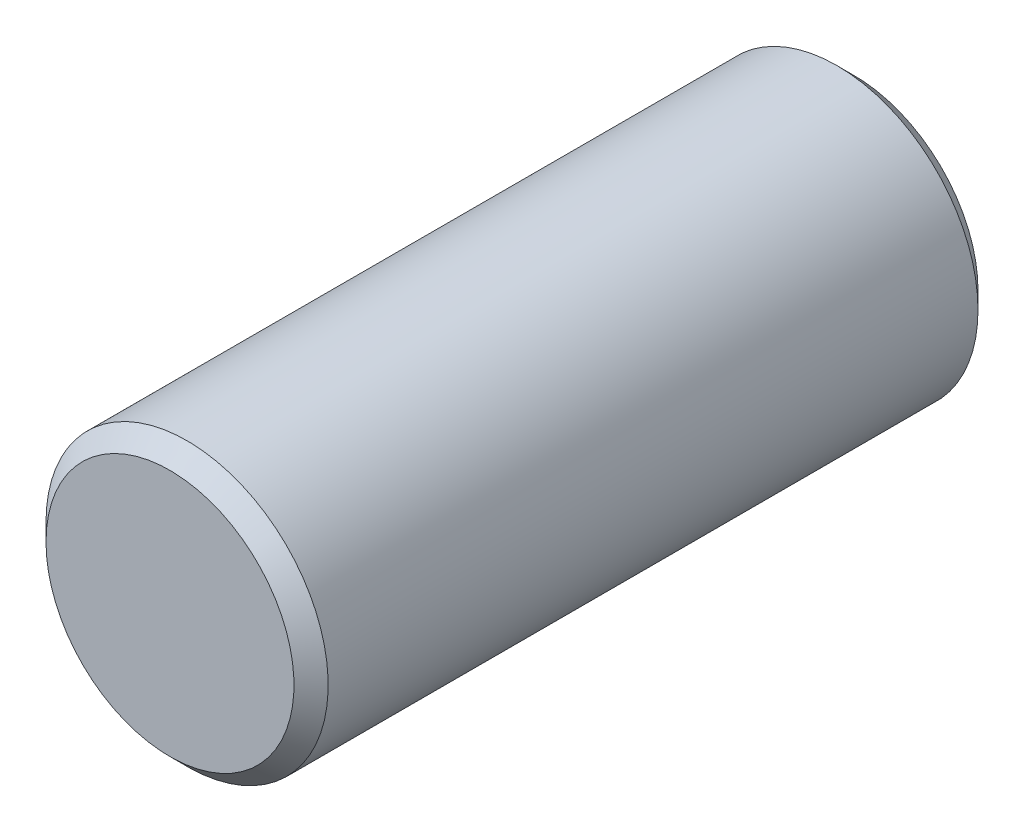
ISO-10303-21;
HEADER;
FILE_DESCRIPTION(('STEP AP214'),'2;1');
FILE_NAME('part.step','',(''),(''),'','','');
FILE_SCHEMA(('AUTOMOTIVE_DESIGN { 1 0 10303 214 1 1 1 1 }'));
ENDSEC;
DATA;
#1=APPLICATION_CONTEXT('core data for automotive mechanical design processes');
#2=APPLICATION_PROTOCOL_DEFINITION('international standard','automotive_design',2000,#1);
#3=PRODUCT_CONTEXT('',#1,'mechanical');
#4=PRODUCT('Part','Part','',(#3));
#5=PRODUCT_RELATED_PRODUCT_CATEGORY('part','',(#4));
#6=PRODUCT_DEFINITION_FORMATION('','',#4);
#7=PRODUCT_DEFINITION_CONTEXT('part definition',#1,'design');
#8=PRODUCT_DEFINITION('design','',#6,#7);
#9=PRODUCT_DEFINITION_SHAPE('','',#8);
#10=(LENGTH_UNIT() NAMED_UNIT(*) SI_UNIT(.MILLI.,.METRE.));
#11=(NAMED_UNIT(*) PLANE_ANGLE_UNIT() SI_UNIT($,.RADIAN.));
#12=(NAMED_UNIT(*) SI_UNIT($,.STERADIAN.) SOLID_ANGLE_UNIT());
#13=UNCERTAINTY_MEASURE_WITH_UNIT(LENGTH_MEASURE(1.E-05),#10,'distance_accuracy_value','');
#14=(GEOMETRIC_REPRESENTATION_CONTEXT(3) GLOBAL_UNCERTAINTY_ASSIGNED_CONTEXT((#13)) GLOBAL_UNIT_ASSIGNED_CONTEXT((#10,
#11,#12)) REPRESENTATION_CONTEXT('',''));
#15=CARTESIAN_POINT('',(0.,0.,0.));
#16=DIRECTION('',(0.,0.,1.));
#17=DIRECTION('',(1.,0.,0.));
#18=AXIS2_PLACEMENT_3D('',#15,#16,#17);
#19=CARTESIAN_POINT('',(0.,0.,4.));
#20=DIRECTION('',(0.,0.,-1.));
#21=DIRECTION('',(-1.,0.,0.));
#22=AXIS2_PLACEMENT_3D('',#19,#20,#21);
#23=CYLINDRICAL_SURFACE('',#22,0.825);
#24=CARTESIAN_POINT('',(0.,0.,0.0999999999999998));
#25=DIRECTION('',(0.,0.,1.));
#26=DIRECTION('',(1.,0.,0.));
#27=AXIS2_PLACEMENT_3D('',#24,#25,#26);
#28=CIRCLE('',#27,0.825);
#29=CARTESIAN_POINT('',(-0.825,0.,0.0999999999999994));
#30=VERTEX_POINT('',#29);
#31=EDGE_CURVE('E360',#30,#30,#28,.T.);
#32=CARTESIAN_POINT('',(0.,0.,3.9));
#33=DIRECTION('',(0.,0.,1.));
#34=DIRECTION('',(1.,0.,0.));
#35=AXIS2_PLACEMENT_3D('',#32,#33,#34);
#36=CIRCLE('',#35,0.825);
#37=CARTESIAN_POINT('',(-0.825,0.,3.9));
#38=VERTEX_POINT('',#37);
#39=EDGE_CURVE('E364',#38,#38,#36,.F.);
#40=CARTESIAN_POINT('',(-0.825,0.,0.0999999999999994));
#41=CARTESIAN_POINT('',(-0.825,0.,0.139583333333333));
#42=CARTESIAN_POINT('',(-0.825,0.,0.179166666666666));
#43=CARTESIAN_POINT('',(-0.825,0.,0.258333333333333));
#44=CARTESIAN_POINT('',(-0.825,0.,0.297916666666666));
#45=CARTESIAN_POINT('',(-0.825,0.,0.377083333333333));
#46=CARTESIAN_POINT('',(-0.825,0.,0.416666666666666));
#47=CARTESIAN_POINT('',(-0.825,0.,0.495833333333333));
#48=CARTESIAN_POINT('',(-0.825,0.,0.535416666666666));
#49=CARTESIAN_POINT('',(-0.825,0.,0.614583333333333));
#50=CARTESIAN_POINT('',(-0.825,0.,0.654166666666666));
#51=CARTESIAN_POINT('',(-0.825,0.,0.733333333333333));
#52=CARTESIAN_POINT('',(-0.825,0.,0.772916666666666));
#53=CARTESIAN_POINT('',(-0.825,0.,0.852083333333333));
#54=CARTESIAN_POINT('',(-0.825,0.,0.891666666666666));
#55=CARTESIAN_POINT('',(-0.825,0.,0.970833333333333));
#56=CARTESIAN_POINT('',(-0.825,0.,1.01041666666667));
#57=CARTESIAN_POINT('',(-0.825,0.,1.08958333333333));
#58=CARTESIAN_POINT('',(-0.825,0.,1.12916666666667));
#59=CARTESIAN_POINT('',(-0.825,0.,1.20833333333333));
#60=CARTESIAN_POINT('',(-0.825,0.,1.24791666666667));
#61=CARTESIAN_POINT('',(-0.825,0.,1.32708333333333));
#62=CARTESIAN_POINT('',(-0.825,0.,1.36666666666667));
#63=CARTESIAN_POINT('',(-0.825,0.,1.44583333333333));
#64=CARTESIAN_POINT('',(-0.825,0.,1.48541666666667));
#65=CARTESIAN_POINT('',(-0.825,0.,1.56458333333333));
#66=CARTESIAN_POINT('',(-0.825,0.,1.60416666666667));
#67=CARTESIAN_POINT('',(-0.825,0.,1.68333333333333));
#68=CARTESIAN_POINT('',(-0.825,0.,1.72291666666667));
#69=CARTESIAN_POINT('',(-0.825,0.,1.80208333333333));
#70=CARTESIAN_POINT('',(-0.825,0.,1.84166666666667));
#71=CARTESIAN_POINT('',(-0.825,0.,1.92083333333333));
#72=CARTESIAN_POINT('',(-0.825,0.,1.96041666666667));
#73=CARTESIAN_POINT('',(-0.825,0.,2.03958333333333));
#74=CARTESIAN_POINT('',(-0.825,0.,2.07916666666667));
#75=CARTESIAN_POINT('',(-0.825,0.,2.15833333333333));
#76=CARTESIAN_POINT('',(-0.825,0.,2.19791666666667));
#77=CARTESIAN_POINT('',(-0.825,0.,2.27708333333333));
#78=CARTESIAN_POINT('',(-0.825,0.,2.31666666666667));
#79=CARTESIAN_POINT('',(-0.825,0.,2.39583333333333));
#80=CARTESIAN_POINT('',(-0.825,0.,2.43541666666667));
#81=CARTESIAN_POINT('',(-0.825,0.,2.51458333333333));
#82=CARTESIAN_POINT('',(-0.825,0.,2.55416666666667));
#83=CARTESIAN_POINT('',(-0.825,0.,2.63333333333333));
#84=CARTESIAN_POINT('',(-0.825,0.,2.67291666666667));
#85=CARTESIAN_POINT('',(-0.825,0.,2.75208333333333));
#86=CARTESIAN_POINT('',(-0.825,0.,2.79166666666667));
#87=CARTESIAN_POINT('',(-0.825,0.,2.87083333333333));
#88=CARTESIAN_POINT('',(-0.825,0.,2.91041666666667));
#89=CARTESIAN_POINT('',(-0.825,0.,2.98958333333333));
#90=CARTESIAN_POINT('',(-0.825,0.,3.02916666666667));
#91=CARTESIAN_POINT('',(-0.825,0.,3.10833333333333));
#92=CARTESIAN_POINT('',(-0.825,0.,3.14791666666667));
#93=CARTESIAN_POINT('',(-0.825,0.,3.22708333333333));
#94=CARTESIAN_POINT('',(-0.825,0.,3.26666666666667));
#95=CARTESIAN_POINT('',(-0.825,0.,3.34583333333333));
#96=CARTESIAN_POINT('',(-0.825,0.,3.38541666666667));
#97=CARTESIAN_POINT('',(-0.825,0.,3.46458333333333));
#98=CARTESIAN_POINT('',(-0.825,0.,3.50416666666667));
#99=CARTESIAN_POINT('',(-0.825,0.,3.58333333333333));
#100=CARTESIAN_POINT('',(-0.825,0.,3.62291666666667));
#101=CARTESIAN_POINT('',(-0.825,0.,3.70208333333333));
#102=CARTESIAN_POINT('',(-0.825,0.,3.74166666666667));
#103=CARTESIAN_POINT('',(-0.825,0.,3.82083333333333));
#104=CARTESIAN_POINT('',(-0.825,0.,3.86041666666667));
#105=CARTESIAN_POINT('',(-0.825,0.,3.9));
#106=B_SPLINE_CURVE_WITH_KNOTS('',3,(#40,#41,#42,#43,#44,#45,#46,#47,#48,#49,#50,#51,#52,#53,
#54,#55,#56,#57,#58,#59,#60,#61,#62,#63,#64,#65,#66,#67,#68,#69,#70,#71,#72,#73,#74,#75,#76,#77,
#78,#79,#80,#81,#82,#83,#84,#85,#86,#87,#88,#89,#90,#91,#92,#93,#94,#95,#96,#97,#98,#99,#100,
#101,#102,#103,#104,#105),.UNSPECIFIED.,.F.,.F.,(4,2,2,2,2,2,2,2,2,2,2,2,2,2,2,2,2,2,2,2,2,2,2,
2,2,2,2,2,2,2,2,2,4),(0.,0.11875,0.2375,0.35625,0.475,0.59375,0.7125,0.83125,0.95,1.06875,
1.1875,1.30625,1.425,1.54375,1.6625,1.78125,1.9,2.01875,2.1375,2.25625,2.375,2.49375,2.6125,
2.73125,2.85,2.96875,3.0875,3.20625,3.325,3.44375,3.5625,3.68125,3.8),.UNSPECIFIED.);
#107=EDGE_CURVE('BSEAM350',#30,#38,#106,.T.);
#108=ORIENTED_EDGE('',*,*,#31,.T.);
#109=ORIENTED_EDGE('',*,*,#39,.T.);
#110=ORIENTED_EDGE('',*,*,#107,.T.);
#111=ORIENTED_EDGE('',*,*,#107,.F.);
#112=EDGE_LOOP('',(#108,#110,#109,#111));
#113=FACE_BOUND('',#112,.T.);
#114=ADVANCED_FACE('F350',(#113),#23,.T.);
#115=CARTESIAN_POINT('',(0.,0.,4.));
#116=DIRECTION('',(0.,0.,1.));
#117=DIRECTION('',(1.,0.,0.));
#118=AXIS2_PLACEMENT_3D('',#115,#116,#117);
#119=PLANE('',#118);
#120=CARTESIAN_POINT('',(0.,0.,4.));
#121=DIRECTION('',(0.,0.,1.));
#122=DIRECTION('',(1.,0.,0.));
#123=AXIS2_PLACEMENT_3D('',#120,#121,#122);
#124=CIRCLE('',#123,0.725);
#125=CARTESIAN_POINT('',(-0.725000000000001,0.,4.));
#126=VERTEX_POINT('',#125);
#127=EDGE_CURVE('E10',#126,#126,#124,.T.);
#128=ORIENTED_EDGE('',*,*,#127,.T.);
#129=EDGE_LOOP('',(#128));
#130=FACE_BOUND('',#129,.T.);
#131=ADVANCED_FACE('F383',(#130),#119,.T.);
#132=CARTESIAN_POINT('',(0.,0.,0.));
#133=DIRECTION('',(0.,0.,1.));
#134=DIRECTION('',(1.,0.,0.));
#135=AXIS2_PLACEMENT_3D('',#132,#133,#134);
#136=PLANE('',#135);
#137=CARTESIAN_POINT('',(0.,0.,0.));
#138=DIRECTION('',(0.,0.,1.));
#139=DIRECTION('',(1.,0.,0.));
#140=AXIS2_PLACEMENT_3D('',#137,#138,#139);
#141=CIRCLE('',#140,0.725);
#142=CARTESIAN_POINT('',(0.725,0.,0.));
#143=VERTEX_POINT('',#142);
#144=EDGE_CURVE('E356',#143,#143,#141,.F.);
#145=ORIENTED_EDGE('',*,*,#144,.T.);
#146=EDGE_LOOP('',(#145));
#147=FACE_BOUND('',#146,.T.);
#148=ADVANCED_FACE('F379',(#147),#136,.F.);
#149=CARTESIAN_POINT('',(0.,0.,0.0999999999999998));
#150=DIRECTION('',(0.,0.,1.));
#151=DIRECTION('',(1.,0.,0.));
#152=AXIS2_PLACEMENT_3D('',#149,#150,#151);
#153=CONICAL_SURFACE('',#152,0.825,0.78539816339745);
#154=ORIENTED_EDGE('',*,*,#144,.F.);
#155=EDGE_LOOP('',(#154));
#156=FACE_BOUND('',#155,.T.);
#157=ORIENTED_EDGE('',*,*,#31,.F.);
#158=EDGE_LOOP('',(#157));
#159=FACE_BOUND('',#158,.T.);
#160=ADVANCED_FACE('F374',(#156,#159),#153,.T.);
#161=CARTESIAN_POINT('',(0.,0.,4.));
#162=DIRECTION('',(0.,0.,-1.));
#163=DIRECTION('',(-1.,0.,0.));
#164=AXIS2_PLACEMENT_3D('',#161,#162,#163);
#165=CONICAL_SURFACE('',#164,0.725,0.785398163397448);
#166=CARTESIAN_POINT('',(-0.825,0.,3.9));
#167=CARTESIAN_POINT('',(-0.823958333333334,0.,3.90104166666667));
#168=CARTESIAN_POINT('',(-0.822916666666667,0.,3.90208333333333));
#169=CARTESIAN_POINT('',(-0.820833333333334,0.,3.90416666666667));
#170=CARTESIAN_POINT('',(-0.819791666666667,0.,3.90520833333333));
#171=CARTESIAN_POINT('',(-0.817708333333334,0.,3.90729166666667));
#172=CARTESIAN_POINT('',(-0.816666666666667,0.,3.90833333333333));
#173=CARTESIAN_POINT('',(-0.814583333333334,0.,3.91041666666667));
#174=CARTESIAN_POINT('',(-0.813541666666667,0.,3.91145833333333));
#175=CARTESIAN_POINT('',(-0.811458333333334,0.,3.91354166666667));
#176=CARTESIAN_POINT('',(-0.810416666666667,0.,3.91458333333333));
#177=CARTESIAN_POINT('',(-0.808333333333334,0.,3.91666666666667));
#178=CARTESIAN_POINT('',(-0.807291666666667,0.,3.91770833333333));
#179=CARTESIAN_POINT('',(-0.805208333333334,0.,3.91979166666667));
#180=CARTESIAN_POINT('',(-0.804166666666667,0.,3.92083333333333));
#181=CARTESIAN_POINT('',(-0.802083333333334,0.,3.92291666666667));
#182=CARTESIAN_POINT('',(-0.801041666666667,0.,3.92395833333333));
#183=CARTESIAN_POINT('',(-0.798958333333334,0.,3.92604166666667));
#184=CARTESIAN_POINT('',(-0.797916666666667,0.,3.92708333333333));
#185=CARTESIAN_POINT('',(-0.795833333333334,0.,3.92916666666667));
#186=CARTESIAN_POINT('',(-0.794791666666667,0.,3.93020833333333));
#187=CARTESIAN_POINT('',(-0.792708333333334,0.,3.93229166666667));
#188=CARTESIAN_POINT('',(-0.791666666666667,0.,3.93333333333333));
#189=CARTESIAN_POINT('',(-0.789583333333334,0.,3.93541666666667));
#190=CARTESIAN_POINT('',(-0.788541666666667,0.,3.93645833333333));
#191=CARTESIAN_POINT('',(-0.786458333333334,0.,3.93854166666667));
#192=CARTESIAN_POINT('',(-0.785416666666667,0.,3.93958333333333));
#193=CARTESIAN_POINT('',(-0.783333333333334,0.,3.94166666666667));
#194=CARTESIAN_POINT('',(-0.782291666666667,0.,3.94270833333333));
#195=CARTESIAN_POINT('',(-0.780208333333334,0.,3.94479166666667));
#196=CARTESIAN_POINT('',(-0.779166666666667,0.,3.94583333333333));
#197=CARTESIAN_POINT('',(-0.777083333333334,0.,3.94791666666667));
#198=CARTESIAN_POINT('',(-0.776041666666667,0.,3.94895833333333));
#199=CARTESIAN_POINT('',(-0.773958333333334,0.,3.95104166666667));
#200=CARTESIAN_POINT('',(-0.772916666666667,0.,3.95208333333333));
#201=CARTESIAN_POINT('',(-0.770833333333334,0.,3.95416666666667));
#202=CARTESIAN_POINT('',(-0.769791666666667,0.,3.95520833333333));
#203=CARTESIAN_POINT('',(-0.767708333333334,0.,3.95729166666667));
#204=CARTESIAN_POINT('',(-0.766666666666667,0.,3.95833333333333));
#205=CARTESIAN_POINT('',(-0.764583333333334,0.,3.96041666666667));
#206=CARTESIAN_POINT('',(-0.763541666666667,0.,3.96145833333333));
#207=CARTESIAN_POINT('',(-0.761458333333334,0.,3.96354166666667));
#208=CARTESIAN_POINT('',(-0.760416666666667,0.,3.96458333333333));
#209=CARTESIAN_POINT('',(-0.758333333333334,0.,3.96666666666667));
#210=CARTESIAN_POINT('',(-0.757291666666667,0.,3.96770833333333));
#211=CARTESIAN_POINT('',(-0.755208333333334,0.,3.96979166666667));
#212=CARTESIAN_POINT('',(-0.754166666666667,0.,3.97083333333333));
#213=CARTESIAN_POINT('',(-0.752083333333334,0.,3.97291666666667));
#214=CARTESIAN_POINT('',(-0.751041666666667,0.,3.97395833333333));
#215=CARTESIAN_POINT('',(-0.748958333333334,0.,3.97604166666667));
#216=CARTESIAN_POINT('',(-0.747916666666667,0.,3.97708333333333));
#217=CARTESIAN_POINT('',(-0.745833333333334,0.,3.97916666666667));
#218=CARTESIAN_POINT('',(-0.744791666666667,0.,3.98020833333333));
#219=CARTESIAN_POINT('',(-0.742708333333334,0.,3.98229166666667));
#220=CARTESIAN_POINT('',(-0.741666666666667,0.,3.98333333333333));
#221=CARTESIAN_POINT('',(-0.739583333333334,0.,3.98541666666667));
#222=CARTESIAN_POINT('',(-0.738541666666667,0.,3.98645833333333));
#223=CARTESIAN_POINT('',(-0.736458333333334,0.,3.98854166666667));
#224=CARTESIAN_POINT('',(-0.735416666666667,0.,3.98958333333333));
#225=CARTESIAN_POINT('',(-0.733333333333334,0.,3.99166666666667));
#226=CARTESIAN_POINT('',(-0.732291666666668,0.,3.99270833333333));
#227=CARTESIAN_POINT('',(-0.730208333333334,0.,3.99479166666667));
#228=CARTESIAN_POINT('',(-0.729166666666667,0.,3.99583333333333));
#229=CARTESIAN_POINT('',(-0.727083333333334,0.,3.99791666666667));
#230=CARTESIAN_POINT('',(-0.726041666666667,0.,3.99895833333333));
#231=CARTESIAN_POINT('',(-0.725000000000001,0.,4.));
#232=B_SPLINE_CURVE_WITH_KNOTS('',3,(#166,#167,#168,#169,#170,#171,#172,#173,#174,#175,#176,
#177,#178,#179,#180,#181,#182,#183,#184,#185,#186,#187,#188,#189,#190,#191,#192,#193,#194,#195,
#196,#197,#198,#199,#200,#201,#202,#203,#204,#205,#206,#207,#208,#209,#210,#211,#212,#213,#214,
#215,#216,#217,#218,#219,#220,#221,#222,#223,#224,#225,#226,#227,#228,#229,#230,#231),
.UNSPECIFIED.,.F.,.F.,(4,2,2,2,2,2,2,2,2,2,2,2,2,2,2,2,2,2,2,2,2,2,2,2,2,2,2,2,2,2,2,2,4),(0.,
0.00441941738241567,0.00883883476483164,0.0132582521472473,0.0176776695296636,
0.0220970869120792,0.0265165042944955,0.0309359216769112,0.0353553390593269,0.0397747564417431,
0.0441941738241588,0.0486135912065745,0.0530330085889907,0.0574524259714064,0.0618718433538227,
0.0662912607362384,0.0707106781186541,0.0751300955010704,0.079549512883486,0.0839689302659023,
0.088388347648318,0.0928077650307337,0.0972271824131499,0.101646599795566,0.106066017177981,
0.110485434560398,0.114904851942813,0.11932426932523,0.123743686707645,0.128163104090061,
0.132582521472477,0.137001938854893,0.141421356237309),.UNSPECIFIED.);
#233=EDGE_CURVE('BSEAM371',#38,#126,#232,.T.);
#234=ORIENTED_EDGE('',*,*,#39,.F.);
#235=ORIENTED_EDGE('',*,*,#127,.F.);
#236=ORIENTED_EDGE('',*,*,#233,.T.);
#237=ORIENTED_EDGE('',*,*,#233,.F.);
#238=EDGE_LOOP('',(#234,#236,#235,#237));
#239=FACE_BOUND('',#238,.T.);
#240=ADVANCED_FACE('F371',(#239),#165,.T.);
#241=CLOSED_SHELL('',(#114,#131,#148,#160,#240));
#242=MANIFOLD_SOLID_BREP('B2',#241);
#243=ADVANCED_BREP_SHAPE_REPRESENTATION('',(#18,#242),#14);
#244=SHAPE_DEFINITION_REPRESENTATION(#9,#243);
ENDSEC;
END-ISO-10303-21;
